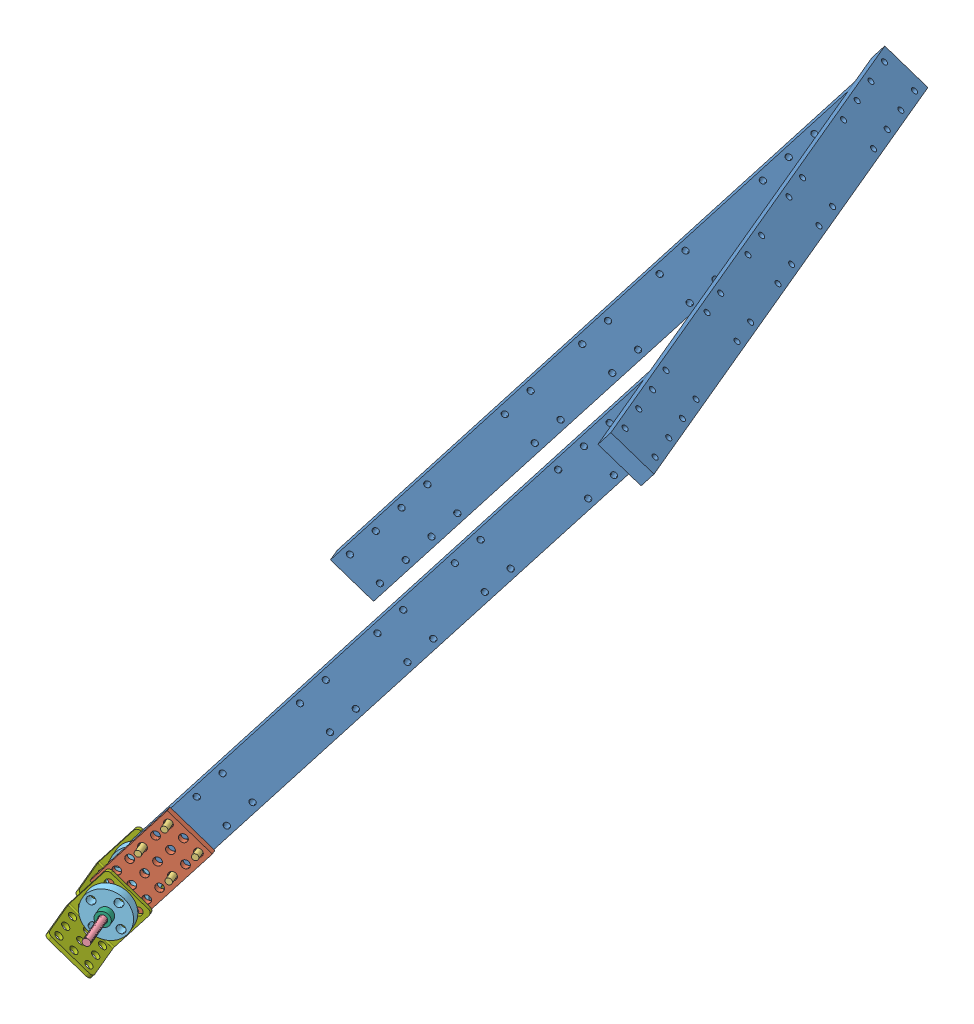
SolidWorks assembly 手.SLDASM, configuration 默认 (file format 10000). Lengths in mm.
Overall size (321.45 301.1 402.75).
26 component instances, 7 part files, 38 mates.
Components (placement in the parent):
- 手基本零件-2: 手基本零件.SLDPRT [默认] at (126.9155 -186.1616 34.9689) x (0.528541 0.776284 -0.34355) z (0.729588 -0.622284 -0.283662) size (321 8 23)
- 手基本零件-4: 手基本零件.SLDPRT [默认] at (231.0726 -161.9882 249.8339) x (0.528541 0.776284 -0.34355) z (0.729588 -0.622284 -0.283662) size (321 8 23)
- 手基本零件-6: 手基本零件.SLDPRT [默认] at (287.9274 44.2904 -66.0553) x (0.433988 0.100723 0.895271) z (-0.729588 0.622284 0.283662) size (321 8 23)
- 6x3-1: 6x3.SLDPRT [默认] at (223.8915 -177.3277 263.9766) x (0.528541 0.776284 -0.34355) z (0.729588 -0.622284 -0.283662) size (48 3 24)
- 钉子-1: 钉子.SLDPRT [默认] at (236.9617 -167.6798 241.7778) x (0.828889 -0.433988 -0.352983) z (-0.352983 -0.895271 0.271833) size (3 20 3)
- 钉子-2: 钉子.SLDPRT [默认] at (225.757 -157.6145 247.2833) x (0.828889 -0.433988 -0.352983) z (-0.352983 -0.895271 0.271833) size (3 20 3)
- 钉子-3: 钉子.SLDPRT [默认] at (228.8302 -180.0249 247.9454) x (0.828889 -0.433988 -0.352983) z (-0.352983 -0.895271 0.271833) size (3 20 3)
- 钉子-4: 钉子.SLDPRT [默认] at (225.6893 -168.0603 271.5721) x (-0.609621 -0.698842 0.374141) z (0.663337 -0.708149 -0.241886) size (3 20 3)
- 柱子-1: 柱子.SLDPRT [默认] at (201.0011 -196.226 239.1908) x (0.828889 -0.433988 -0.352983) z (-0.352983 -0.895271 0.271833) size (3.5 75 3.5)
- 法-1: 法.SLDASM [默认] at (229.3162 -207.4031 261.7415) x (0.529179 0.77574 -0.343797) z (-0.729126 0.622962 0.283362) size (22.24 9 22.24)
  - 法兰轴2-1: 法兰轴2.SLDPRT [默认] at (27.956 -2.676 36.0053) size (22.24 5 22.24)
  - 法老你-1: 法老你.SLDPRT [默认] at (11.6244 2.324 33.7573) size (7 4 7)
- 法老你-1: 法老你.SLDPRT [默认] at (213.1373 -207.5727 262.5396) x (-0.609621 -0.698842 0.374141) z (0.663337 -0.708149 -0.241886) size (7 4 7)
- 法-2: 法.SLDASM [默认] at (217.237 -175.2183 245.3805) x (0.729588 -0.622284 -0.283662) z (-0.528541 -0.776284 0.34355) size (22.24 9 22.24)
  - 法兰轴2-1: 法兰轴2.SLDPRT [默认] at (27.956 -2.676 36.0053) size (22.24 5 22.24)
  - 法老你-1: 法老你.SLDPRT [默认] at (11.6244 2.324 33.7573) size (7 4 7)
- 搞了半天的90度折角件-1: 搞了半天的90度折角件.SLDPRT [默认] at (200.0103 -194.9567 279.7704) x (-0.433988 -0.100723 -0.895271) z (0.729588 -0.622284 -0.283662) size (26 26 24)
- 法-3: 法.SLDASM [默认] at (188.5277 -179.0824 251.5202) x (-0.528541 -0.776284 0.34355) z (0.729588 -0.622284 -0.283662) size (22.24 9 22.24)
  - 法兰轴2-1: 法兰轴2.SLDPRT [默认] at (27.956 -2.676 36.0053) size (22.24 5 22.24)
  - 法老你-1: 法老你.SLDPRT [默认] at (11.6244 2.324 33.7573) size (7 4 7)
- 法老你-2: 法老你.SLDPRT [默认] at (220.5456 -205.9589 272.1706) x (0.828889 -0.433988 -0.352983) z (-0.352983 -0.895271 0.271833) size (7 4 7)
- 法老你-3: 法老你.SLDPRT [默认] at (222.2815 -205.556 275.7517) x (0.828889 -0.433988 -0.352983) z (-0.352983 -0.895271 0.271833) size (7 4 7)
- 搞了半天的90度折角件-2: 搞了半天的90度折角件.SLDPRT [默认] at (215.1998 -191.4314 311.1049) x (-0.433988 -0.100723 -0.895271) z (0.729588 -0.622284 -0.283662) size (26 26 24)
- 法-4: 法.SLDASM [默认] at (232.4266 -171.693 276.715) x (0.729588 -0.622284 -0.283662) z (-0.528541 -0.776284 0.34355) size (22.24 9 22.24)
  - 法兰轴2-1: 法兰轴2.SLDPRT [默认] at (27.956 -2.676 36.0053) size (22.24 5 22.24)
  - 法老你-1: 法老你.SLDPRT [默认] at (11.6244 2.324 33.7573) size (7 4 7)
Mates (geometry in assembly coordinates):
- 重合7: coincident anti-aligned: line of 手基本零件-2 through (280.868 52.8332 -57.6128) axis (-0.433988 -0.100723 -0.895271); line of 手基本零件-6 through (268.8681 50.0481 -82.3675) axis (0.433988 0.100723 0.895271)
- 平行5: parallel aligned: line of 手基本零件-2 through (294.1767 37.7148 -71.2992) axis (-0.729588 0.622284 0.283662); line of 手基本零件-6 through (285.6486 35.7356 -88.8917) axis (-0.729588 0.622284 0.283662)
- 平行6: parallel anti-aligned: plane of 手基本零件-2 through (130.3874 -185.3558 42.1311) normal (0.433988 0.100723 0.895271); plane of 6x3-1 through (223.8915 -177.3277 263.9766) normal (-0.433988 -0.100723 -0.895271)
- 平行7: parallel anti-aligned: line of 手基本零件-2 through (111.2063 -196.3542 52.6666) axis (0.729588 -0.622284 -0.283662); line of 6x3-1 through (247.3078 -165.0684 251.2461) axis (-0.729588 0.622284 0.283662)
- 平行8: parallel anti-aligned: plane of 手基本零件-4 through (231.0726 -161.9882 249.8339) normal (-0.433988 -0.100723 -0.895271); plane of 6x3-1 through (225.1935 -177.0255 266.6624) normal (0.433988 0.100723 0.895271)
- 平行9: parallel anti-aligned: plane of 6x3-1 through (223.8915 -177.3277 263.9766) normal (-0.433988 -0.100723 -0.895271); plane of 钉子-1 through (245.2134 -165.0025 259.8161) normal (0.433988 0.100723 0.895271)
- 平行10: parallel aligned: plane of 6x3-1 through (223.8915 -177.3277 263.9766) normal (-0.433988 -0.100723 -0.895271); plane of 钉子-2 through (225.329 -156.9516 247.4163) normal (-0.433988 -0.100723 -0.895271)
- 平行11: parallel aligned: plane of 6x3-1 through (223.8915 -177.3277 263.9766) normal (-0.433988 -0.100723 -0.895271); plane of 钉子-3 through (228.4022 -179.3621 248.0783) normal (-0.433988 -0.100723 -0.895271)
- 平行12: parallel aligned: plane of 6x3-1 through (223.8915 -177.3277 263.9766) normal (-0.433988 -0.100723 -0.895271); plane of 柱子-1 through (200.5294 -195.1849 239.3023) normal (-0.433988 -0.100723 -0.895271)
- 同心7: concentric anti-aligned: circle of 6x3-1; circle of 法-1/法兰轴2-1
- 重合27: coincident anti-aligned: plane of 6x3-1 through (223.8915 -177.3277 263.9766) normal (-0.433988 -0.100723 -0.895271); plane of 法-1/法兰轴2-1 through (215.2969 -191.7575 269.7663) normal (0.433988 0.100723 0.895271)
- 重合28: coincident anti-aligned: plane of 法-1/法老你-1 through (211.391 -192.664 261.7088) normal (-0.433988 -0.100723 -0.895271); plane of 法老你-1 through (211.391 -192.664 261.7088) normal (0.433988 0.100723 0.895271)
- 同心8: concentric aligned: circle of 法-1/法老你-1; circle of 法老你-1
- 重合30: coincident anti-aligned: plane of 法老你-1 through (209.6551 -193.0669 258.1277) normal (-0.433988 -0.100723 -0.895271); plane of 法-2/法老你-1 through (209.6551 -193.0669 258.1277) normal (0.433988 0.100723 0.895271)
- 重合31: coincident anti-aligned: circle of 法老你-1; circle of 法-2/法老你-1
- 平行15: parallel anti-aligned: plane of 法-2/法兰轴2-1 through (205.7492 -193.9734 250.0703) normal (-0.433988 -0.100723 -0.895271); plane of 搞了半天的90度折角件-1 through (203.3366 -177.1906 249.3517) normal (0.433988 0.100723 0.895271)
- 同心9: concentric aligned: circle of 法-2/法兰轴2-1; circle of 搞了半天的90度折角件-1
- 同心10: concentric aligned: circle of 法-2/法兰轴2-1; circle of 搞了半天的90度折角件-1
- 重合35: coincident anti-aligned: plane of 法-2/法兰轴2-1 through (205.7492 -193.9734 250.0703) normal (-0.433988 -0.100723 -0.895271); plane of 搞了半天的90度折角件-1 through (203.3366 -177.1906 249.3517) normal (0.433988 0.100723 0.895271)
- 重合36: coincident anti-aligned: plane of 搞了半天的90度折角件-1 through (189.7837 -196.0229 255.8063) normal (-0.433988 -0.100723 -0.895271); plane of 法-3/法兰轴2-1 through (204.8812 -194.1749 248.2798) normal (0.433988 0.100723 0.895271)
- 同心11: concentric anti-aligned: circle of 搞了半天的90度折角件-1; circle of 法-3/法兰轴2-1
- 同心12: concentric anti-aligned: circle of 搞了半天的90度折角件-1; circle of 法-3/法兰轴2-1
- 同心13: concentric aligned: circle of 6x3-1; circle of 法-2/法兰轴2-1
- 重合37: coincident aligned: circle of 6x3-1; circle of 法老你-2
- 重合38: coincident aligned: circle of 法老你-2; circle of 法老你-3
- 平行16: parallel aligned: plane of 6x3-1 through (225.1935 -177.0255 266.6624) normal (0.433988 0.100723 0.895271); plane of 搞了半天的90度折角件-2 through (218.5262 -173.6653 280.6861) normal (0.433988 0.100723 0.895271)
- 同心17: concentric aligned: circle of 法老你-3; circle of 搞了半天的90度折角件-2
- 同心19: concentric aligned: cylinder of 搞了半天的90度折角件-1 through (203.5988 -183.2643 247.6739) axis (0.433988 0.100723 0.895271) radius 2; circle of 搞了半天的90度折角件-2
- 重合53: coincident aligned: circle of 法老你-3; circle of 搞了半天的90度折角件-2
- 重合54: coincident aligned: circle of 搞了半天的90度折角件-2; circle of 法-4/法兰轴2-1
- 同心20: concentric aligned: circle of 搞了半天的90度折角件-2; circle of 法-4/法兰轴2-1
- 重合56: coincident anti-aligned: plane of 手基本零件-4 through (234.5445 -161.1824 256.996) normal (0.433988 0.100723 0.895271); plane of 6x3-1 through (223.8915 -177.3277 263.9766) normal (-0.433988 -0.100723 -0.895271)
- 同心21: concentric aligned: circle of 手基本零件-4; circle of 钉子-1
- 同心22: concentric aligned: circle of 手基本零件-4; circle of 钉子-2
- 同心23: concentric aligned: circle of 手基本零件-4; circle of 钉子-3
- 同心24: concentric anti-aligned: circle of 手基本零件-4; circle of 钉子-4
- 同心27: concentric anti-aligned: circle of 柱子-1; circle of 法-3/法老你-1
- 同心28: concentric aligned: circle of 手基本零件-4; circle of 6x3-1
